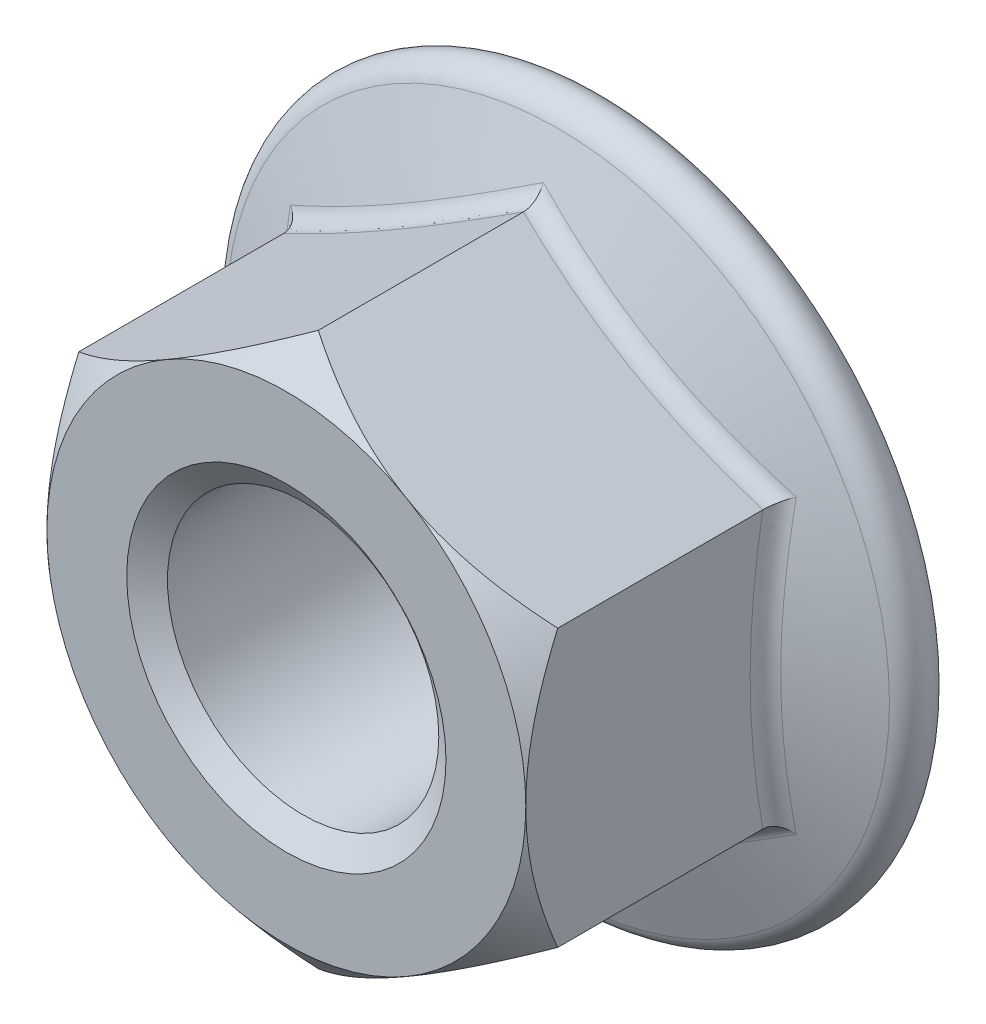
from build123d import *

# Parameters (mm, degrees)
BASENUTSKE_R   = 4.25
BASENUT_DEPTH  = 10
FLANGEFILLET_R = 0.6


with BuildPart() as part:
    # BaseNutSke → BaseNut (new body)
    with BuildSketch(Plane.XY):
        Polygon((7.5, 4.330127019), (7.5, -4.330127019), (0, -8.660254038), (-7.5, -4.330127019), (-7.5, 4.330127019), (0, 8.660254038), align=None)
        Circle(BASENUTSKE_R, mode=Mode.SUBTRACT)
    extrude(amount=-BASENUT_DEPTH)

    # Sketch6 → Flange (revolve)
    with BuildSketch(Plane(origin=(0, 0, 0), x_dir=(0, 0, -1), z_dir=(1, 0, 0)), mode=Mode.PRIVATE) as flange_sk:
        with BuildLine():
            Line((6.264796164, 4.25), (8.5, 10.391172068))
            ThreePointArc((8.5, 10.391172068), (9.360966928, 10.888251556), (10, 10.126681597))
            Line((10, 10.126681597), (10, 4.25))
            Line((10, 4.25), (6.264796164, 4.25))
        make_face()
    revolve(flange_sk.sketch.rotate(Axis((0, 0, 0), (0, 0, -1)), 90), axis=Axis((0, 0, 0), (0, 0, -1)))

    # Sketch3 → Double-Chamfer (revolve, cut)
    with BuildSketch(Plane(origin=(0, 0, 0), x_dir=(0, 0, -1), z_dir=(1, 0, 0)), mode=Mode.PRIVATE) as double_chamfer_sk:
        Polygon((1, 21.360254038), (-12.7, 21.360254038), (-12.7, 7.5), (0, 7.5), (1, 8.660254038), align=None)
    revolve(double_chamfer_sk.sketch.rotate(Axis((0, 0, 0), (0, 0, -1)), 90), axis=Axis((0, 0, 0), (0, 0, -1)), mode=Mode.SUBTRACT)

    # FlangeFillet
    flangefillet_edges = [part.edges().sort_by_distance(p)[0] for p in [
        (7.5, -2.17450822, -7.560119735),
        (7.5, 2.17450822, -7.560119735),
        (3.75, -6.495190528, -7.447699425),
        (3.75, 6.495190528, -7.447699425),
        (-3.75, 6.495190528, -7.447699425),
        (-7.5, 0, -7.447699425),
        (-3.75, -6.495190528, -7.447699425),
    ]]
    fillet(flangefillet_edges, radius=FLANGEFILLET_R)

    # Sketch5 (on Right Plane) → EndChamfer (revolve, cut)
    with BuildSketch(Plane(origin=(0, 0, 0), x_dir=(0, 0, -1), z_dir=(1, 0, 0)), mode=Mode.PRIVATE) as endchamfer_sk:
        Polygon((9.9746, 5), (9.396928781, 4.175), (10.0254, 4.175), (10.0254, 5), align=None)
        Polygon((-0.0508, 5), (0, 5), (0.577671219, 4.175), (-0.0508, 4.175), align=None)
    revolve(endchamfer_sk.sketch.rotate(Axis((0, 0, -25.037505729), (0, 0, -1)), 90), axis=Axis((0, 0, -25.037505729), (0, 0, -1)), mode=Mode.SUBTRACT)


solid = part.part
